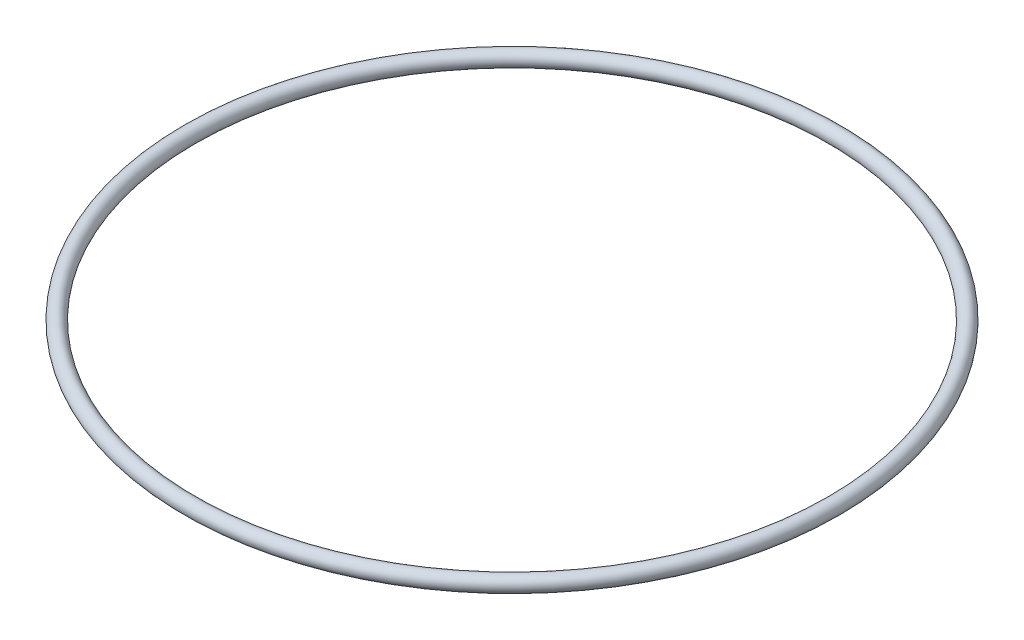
from build123d import *

# Parameters (mm, degrees)
ESQUISSE1_R = 2


with BuildPart() as part:
    # Esquisse1 → Base-R_volution (revolve)
    with BuildSketch(Plane.XY, mode=Mode.PRIVATE) as base_r_volution_sk:
        with Locations((84.5, 0)):
            Circle(ESQUISSE1_R)
    revolve(base_r_volution_sk.sketch.rotate(Axis((0, 2, 0), (0, -1, 0)), 180), axis=Axis((0, 2, 0), (0, -1, 0)))


solid = part.part
